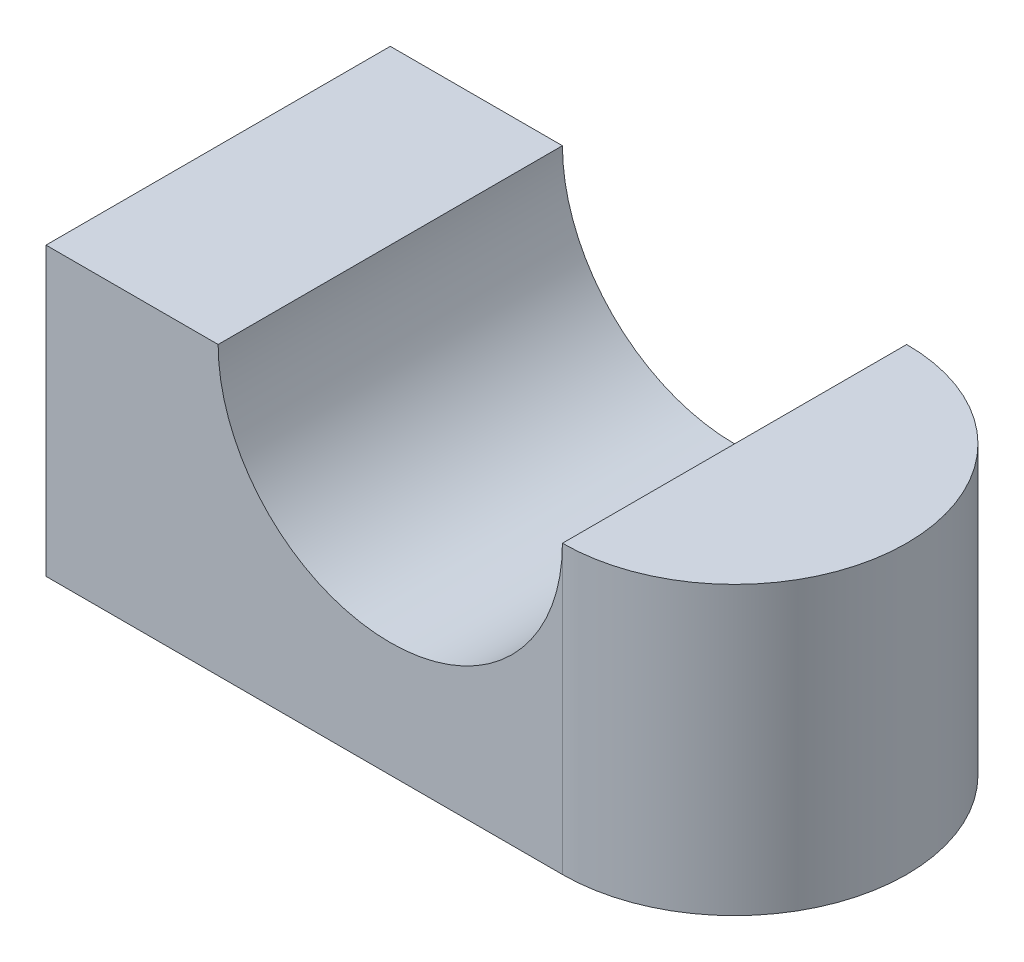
from build123d import *

# Parameters (mm, degrees)
EXTRUDE1_DEPTH = 15
FILLET1_RADIUS = 15
FILLET1_LENGTH = 25


with BuildPart() as part:
    # Sketch1 → Extrude1 (new, symmetric)
    with BuildSketch(Plane.XY):
        with BuildLine():
            Line((0, 0), (60, 0))
            Line((60, 0), (60, 25))
            Line((60, 25), (45, 25))
            ThreePointArc((45, 25), (30, 10), (15, 25))
            Line((15, 25), (0, 25))
            Line((0, 25), (0, 0))
        make_face()
    extrude(amount=EXTRUDE1_DEPTH, both=True)

    # Fillet1: full round fillet: the end face becomes a half cylinder, R = half its width
    fillet1_face = Plane((60, 12.5, 0), x_dir=(0, -1, 0), z_dir=(1, 0, 0))  # on the end face: x along it, z out of the body
    fillet1_slab = fillet1_face.offset(-FILLET1_RADIUS / 2) * Box(FILLET1_LENGTH, 2 * FILLET1_RADIUS, FILLET1_RADIUS, mode=Mode.PRIVATE)  # the body's end, R deep
    fillet1_round = Plane((45, 12.5, 0), x_dir=(1, 0, 0), z_dir=(0, -1, 0)) * Cylinder(FILLET1_RADIUS, FILLET1_LENGTH, mode=Mode.PRIVATE)  # its axis R under the face
    add(fillet1_slab - fillet1_round, mode=Mode.SUBTRACT)


solid = part.part
